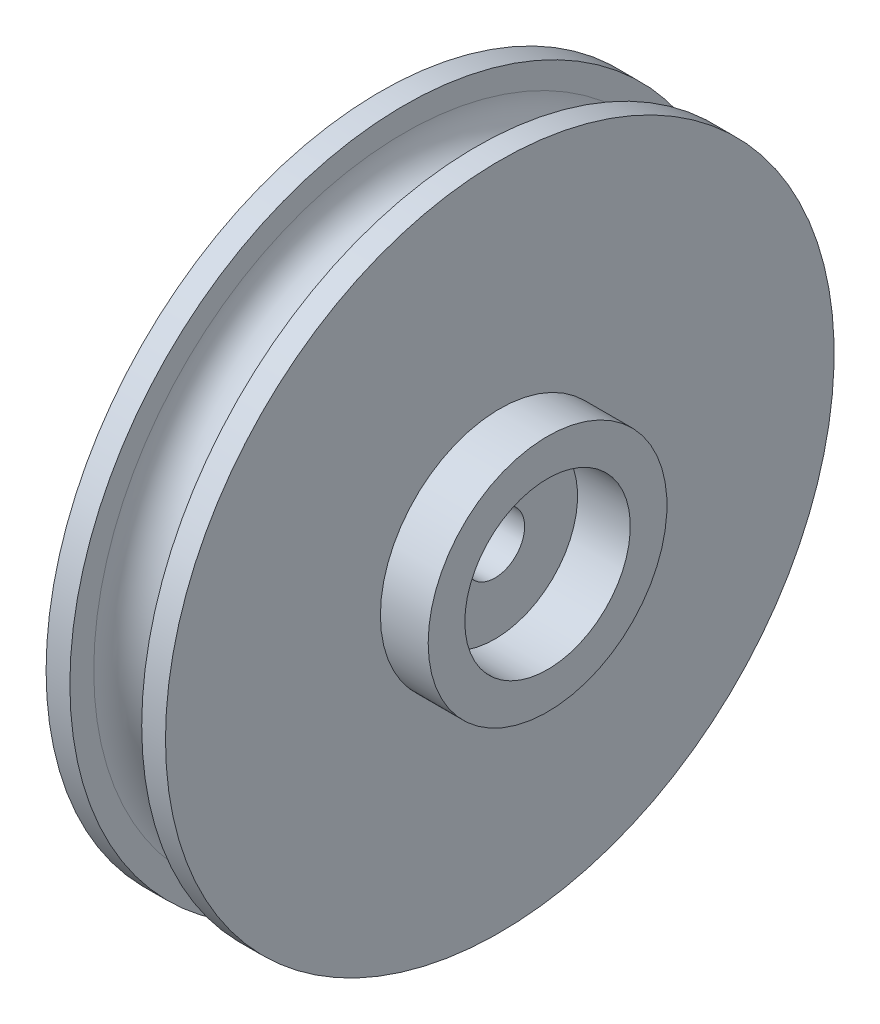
from build123d import *


with BuildPart() as part:
    # Sketch1 → Revolve2 (revolve)
    with BuildSketch(Plane.XY, mode=Mode.PRIVATE) as revolve2_sk:
        with BuildLine():
            Line((7.9375, 15.875), (7.9375, 44.45))
            Line((7.9375, 44.45), (4.7752, 44.45))
            Line((4.7752, 44.45), (4.7752, 41.275))
            ThreePointArc((4.7752, 41.275), (0, 36.4998), (-4.7752, 41.275))
            Line((-4.7752, 41.275), (-4.7752, 44.45))
            Line((-4.7752, 44.45), (-7.9375, 44.45))
            Line((-7.9375, 44.45), (-7.9375, 15.875))
            Line((-7.9375, 15.875), (-14.2875, 15.875))
            Line((-14.2875, 15.875), (-14.2875, 11))
            Line((-14.2875, 11), (-7.2771, 11))
            Line((-7.2771, 11), (-7.2771, 3.9624))
            Line((-7.2771, 3.9624), (7.2771, 3.9624))
            Line((7.2771, 3.9624), (7.2771, 11))
            Line((7.2771, 11), (14.2875, 11))
            Line((14.2875, 11), (14.2875, 15.875))
            Line((14.2875, 15.875), (7.9375, 15.875))
        make_face()
    revolve(revolve2_sk.sketch.rotate(Axis((0, 0, 0), (1, 0, 0)), 90), axis=Axis((0, 0, 0), (1, 0, 0)))


solid = part.part
